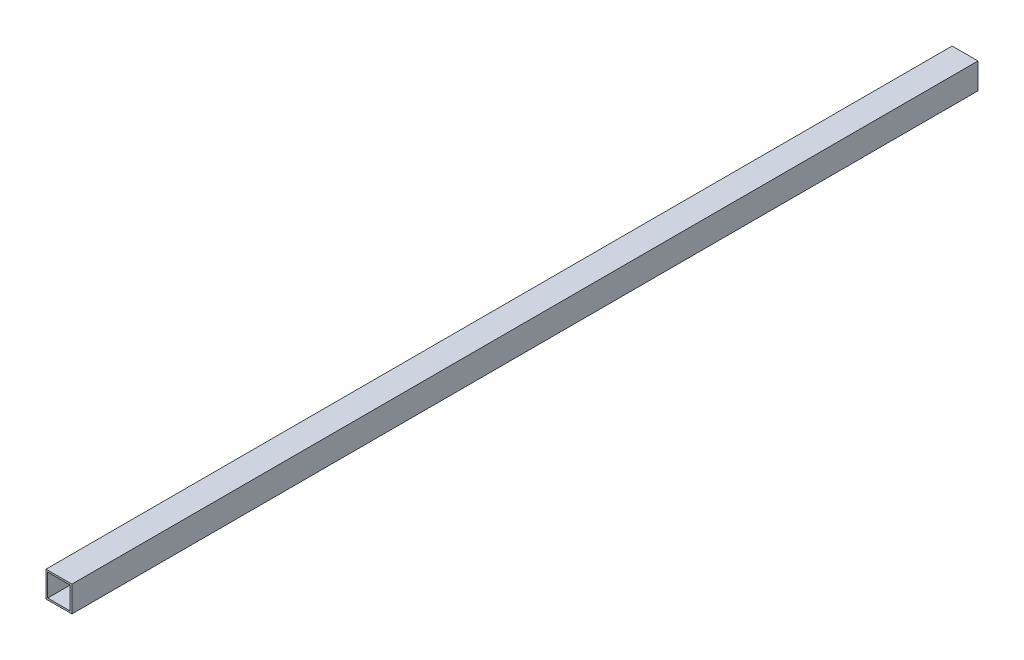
ISO-10303-21;
HEADER;
FILE_DESCRIPTION(('STEP AP214'),'2;1');
FILE_NAME('part.step','',(''),(''),'','','');
FILE_SCHEMA(('AUTOMOTIVE_DESIGN { 1 0 10303 214 1 1 1 1 }'));
ENDSEC;
DATA;
#1=APPLICATION_CONTEXT('core data for automotive mechanical design processes');
#2=APPLICATION_PROTOCOL_DEFINITION('international standard','automotive_design',2000,#1);
#3=PRODUCT_CONTEXT('',#1,'mechanical');
#4=PRODUCT('Part','Part','',(#3));
#5=PRODUCT_RELATED_PRODUCT_CATEGORY('part','',(#4));
#6=PRODUCT_DEFINITION_FORMATION('','',#4);
#7=PRODUCT_DEFINITION_CONTEXT('part definition',#1,'design');
#8=PRODUCT_DEFINITION('design','',#6,#7);
#9=PRODUCT_DEFINITION_SHAPE('','',#8);
#10=(LENGTH_UNIT() NAMED_UNIT(*) SI_UNIT(.MILLI.,.METRE.));
#11=(NAMED_UNIT(*) PLANE_ANGLE_UNIT() SI_UNIT($,.RADIAN.));
#12=(NAMED_UNIT(*) SI_UNIT($,.STERADIAN.) SOLID_ANGLE_UNIT());
#13=UNCERTAINTY_MEASURE_WITH_UNIT(LENGTH_MEASURE(1.E-05),#10,'distance_accuracy_value','');
#14=(GEOMETRIC_REPRESENTATION_CONTEXT(3) GLOBAL_UNCERTAINTY_ASSIGNED_CONTEXT((#13)) GLOBAL_UNIT_ASSIGNED_CONTEXT((#10,
#11,#12)) REPRESENTATION_CONTEXT('',''));
#15=CARTESIAN_POINT('',(0.,0.,0.));
#16=DIRECTION('',(0.,0.,1.));
#17=DIRECTION('',(1.,0.,0.));
#18=AXIS2_PLACEMENT_3D('',#15,#16,#17);
#19=CARTESIAN_POINT('',(0.,0.,2100.));
#20=DIRECTION('',(0.,0.,1.));
#21=DIRECTION('',(1.,0.,0.));
#22=AXIS2_PLACEMENT_3D('',#19,#20,#21);
#23=PLANE('',#22);
#24=DIRECTION('',(0.,-1.,0.));
#25=VECTOR('',#24,1.);
#26=CARTESIAN_POINT('',(-26.,26.,2100.));
#27=LINE('',#26,#25);
#28=CARTESIAN_POINT('',(-26.,26.,2100.));
#29=VERTEX_POINT('',#28);
#30=CARTESIAN_POINT('',(-26.,-26.,2100.));
#31=VERTEX_POINT('',#30);
#32=EDGE_CURVE('E25',#29,#31,#27,.T.);
#33=ORIENTED_EDGE('',*,*,#32,.F.);
#34=DIRECTION('',(-1.,0.,0.));
#35=VECTOR('',#34,1.);
#36=CARTESIAN_POINT('',(26.,26.,2100.));
#37=LINE('',#36,#35);
#38=CARTESIAN_POINT('',(26.,26.,2100.));
#39=VERTEX_POINT('',#38);
#40=EDGE_CURVE('E132',#39,#29,#37,.T.);
#41=ORIENTED_EDGE('',*,*,#40,.F.);
#42=DIRECTION('',(0.,1.,0.));
#43=VECTOR('',#42,1.);
#44=CARTESIAN_POINT('',(26.,-26.,2100.));
#45=LINE('',#44,#43);
#46=CARTESIAN_POINT('',(26.,-26.,2100.));
#47=VERTEX_POINT('',#46);
#48=EDGE_CURVE('E103',#47,#39,#45,.T.);
#49=ORIENTED_EDGE('',*,*,#48,.F.);
#50=DIRECTION('',(1.,0.,0.));
#51=VECTOR('',#50,1.);
#52=CARTESIAN_POINT('',(-26.,-26.,2100.));
#53=LINE('',#52,#51);
#54=EDGE_CURVE('E100',#31,#47,#53,.T.);
#55=ORIENTED_EDGE('',*,*,#54,.F.);
#56=EDGE_LOOP('',(#33,#41,#49,#55));
#57=FACE_BOUND('',#56,.T.);
#58=DIRECTION('',(1.,0.,0.));
#59=VECTOR('',#58,1.);
#60=CARTESIAN_POINT('',(-30.,-30.,2100.));
#61=LINE('',#60,#59);
#62=CARTESIAN_POINT('',(-30.,-30.,2100.));
#63=VERTEX_POINT('',#62);
#64=CARTESIAN_POINT('',(30.,-30.,2100.));
#65=VERTEX_POINT('',#64);
#66=EDGE_CURVE('E155',#63,#65,#61,.T.);
#67=ORIENTED_EDGE('',*,*,#66,.T.);
#68=DIRECTION('',(0.,1.,0.));
#69=VECTOR('',#68,1.);
#70=CARTESIAN_POINT('',(30.,-30.,2100.));
#71=LINE('',#70,#69);
#72=CARTESIAN_POINT('',(30.,30.,2100.));
#73=VERTEX_POINT('',#72);
#74=EDGE_CURVE('E149',#65,#73,#71,.T.);
#75=ORIENTED_EDGE('',*,*,#74,.T.);
#76=DIRECTION('',(-1.,0.,0.));
#77=VECTOR('',#76,1.);
#78=CARTESIAN_POINT('',(30.,30.,2100.));
#79=LINE('',#78,#77);
#80=CARTESIAN_POINT('',(-30.,30.,2100.));
#81=VERTEX_POINT('',#80);
#82=EDGE_CURVE('E166',#73,#81,#79,.T.);
#83=ORIENTED_EDGE('',*,*,#82,.T.);
#84=DIRECTION('',(0.,-1.,0.));
#85=VECTOR('',#84,1.);
#86=CARTESIAN_POINT('',(-30.,30.,2100.));
#87=LINE('',#86,#85);
#88=EDGE_CURVE('E115',#81,#63,#87,.T.);
#89=ORIENTED_EDGE('',*,*,#88,.T.);
#90=EDGE_LOOP('',(#67,#75,#83,#89));
#91=FACE_BOUND('',#90,.T.);
#92=ADVANCED_FACE('F16',(#57,#91),#23,.T.);
#93=CARTESIAN_POINT('',(0.,0.,0.));
#94=DIRECTION('',(0.,0.,1.));
#95=DIRECTION('',(1.,0.,0.));
#96=AXIS2_PLACEMENT_3D('',#93,#94,#95);
#97=PLANE('',#96);
#98=DIRECTION('',(1.,0.,0.));
#99=VECTOR('',#98,1.);
#100=CARTESIAN_POINT('',(-26.,-26.,0.));
#101=LINE('',#100,#99);
#102=CARTESIAN_POINT('',(-26.,-26.,0.));
#103=VERTEX_POINT('',#102);
#104=CARTESIAN_POINT('',(26.,-26.,0.));
#105=VERTEX_POINT('',#104);
#106=EDGE_CURVE('E113',#103,#105,#101,.T.);
#107=ORIENTED_EDGE('',*,*,#106,.T.);
#108=DIRECTION('',(0.,1.,0.));
#109=VECTOR('',#108,1.);
#110=CARTESIAN_POINT('',(26.,-26.,0.));
#111=LINE('',#110,#109);
#112=CARTESIAN_POINT('',(26.,26.,0.));
#113=VERTEX_POINT('',#112);
#114=EDGE_CURVE('E128',#105,#113,#111,.T.);
#115=ORIENTED_EDGE('',*,*,#114,.T.);
#116=DIRECTION('',(-1.,0.,0.));
#117=VECTOR('',#116,1.);
#118=CARTESIAN_POINT('',(26.,26.,0.));
#119=LINE('',#118,#117);
#120=CARTESIAN_POINT('',(-26.,26.,0.));
#121=VERTEX_POINT('',#120);
#122=EDGE_CURVE('E98',#113,#121,#119,.T.);
#123=ORIENTED_EDGE('',*,*,#122,.T.);
#124=DIRECTION('',(0.,-1.,0.));
#125=VECTOR('',#124,1.);
#126=CARTESIAN_POINT('',(-26.,26.,0.));
#127=LINE('',#126,#125);
#128=EDGE_CURVE('E10',#121,#103,#127,.T.);
#129=ORIENTED_EDGE('',*,*,#128,.T.);
#130=EDGE_LOOP('',(#107,#115,#123,#129));
#131=FACE_BOUND('',#130,.T.);
#132=DIRECTION('',(0.,-1.,0.));
#133=VECTOR('',#132,1.);
#134=CARTESIAN_POINT('',(-30.,30.,0.));
#135=LINE('',#134,#133);
#136=CARTESIAN_POINT('',(-30.,30.,0.));
#137=VERTEX_POINT('',#136);
#138=CARTESIAN_POINT('',(-30.,-30.,0.));
#139=VERTEX_POINT('',#138);
#140=EDGE_CURVE('E119',#137,#139,#135,.T.);
#141=ORIENTED_EDGE('',*,*,#140,.F.);
#142=DIRECTION('',(-1.,0.,0.));
#143=VECTOR('',#142,1.);
#144=CARTESIAN_POINT('',(30.,30.,0.));
#145=LINE('',#144,#143);
#146=CARTESIAN_POINT('',(30.,30.,0.));
#147=VERTEX_POINT('',#146);
#148=EDGE_CURVE('E174',#147,#137,#145,.T.);
#149=ORIENTED_EDGE('',*,*,#148,.F.);
#150=DIRECTION('',(0.,1.,0.));
#151=VECTOR('',#150,1.);
#152=CARTESIAN_POINT('',(30.,-30.,0.));
#153=LINE('',#152,#151);
#154=CARTESIAN_POINT('',(30.,-30.,0.));
#155=VERTEX_POINT('',#154);
#156=EDGE_CURVE('E150',#155,#147,#153,.T.);
#157=ORIENTED_EDGE('',*,*,#156,.F.);
#158=DIRECTION('',(1.,0.,0.));
#159=VECTOR('',#158,1.);
#160=CARTESIAN_POINT('',(-30.,-30.,0.));
#161=LINE('',#160,#159);
#162=EDGE_CURVE('E156',#139,#155,#161,.T.);
#163=ORIENTED_EDGE('',*,*,#162,.F.);
#164=EDGE_LOOP('',(#141,#149,#157,#163));
#165=FACE_BOUND('',#164,.T.);
#166=ADVANCED_FACE('F18',(#131,#165),#97,.F.);
#167=CARTESIAN_POINT('',(-26.,26.,0.));
#168=DIRECTION('',(1.,0.,0.));
#169=DIRECTION('',(0.,1.,0.));
#170=AXIS2_PLACEMENT_3D('',#167,#168,#169);
#171=PLANE('',#170);
#172=DIRECTION('',(0.,0.,1.));
#173=VECTOR('',#172,1.);
#174=CARTESIAN_POINT('',(-26.,26.,0.));
#175=LINE('',#174,#173);
#176=EDGE_CURVE('E95',#121,#29,#175,.T.);
#177=ORIENTED_EDGE('',*,*,#176,.T.);
#178=ORIENTED_EDGE('',*,*,#32,.T.);
#179=DIRECTION('',(0.,0.,1.));
#180=VECTOR('',#179,1.);
#181=CARTESIAN_POINT('',(-26.,-26.,0.));
#182=LINE('',#181,#180);
#183=EDGE_CURVE('E93',#103,#31,#182,.T.);
#184=ORIENTED_EDGE('',*,*,#183,.F.);
#185=ORIENTED_EDGE('',*,*,#128,.F.);
#186=EDGE_LOOP('',(#177,#178,#184,#185));
#187=FACE_BOUND('',#186,.T.);
#188=ADVANCED_FACE('F91',(#187),#171,.T.);
#189=CARTESIAN_POINT('',(26.,26.,0.));
#190=DIRECTION('',(0.,-1.,0.));
#191=DIRECTION('',(0.,0.,-1.));
#192=AXIS2_PLACEMENT_3D('',#189,#190,#191);
#193=PLANE('',#192);
#194=DIRECTION('',(0.,0.,1.));
#195=VECTOR('',#194,1.);
#196=CARTESIAN_POINT('',(26.,26.,0.));
#197=LINE('',#196,#195);
#198=EDGE_CURVE('E127',#113,#39,#197,.T.);
#199=ORIENTED_EDGE('',*,*,#198,.T.);
#200=ORIENTED_EDGE('',*,*,#40,.T.);
#201=ORIENTED_EDGE('',*,*,#176,.F.);
#202=ORIENTED_EDGE('',*,*,#122,.F.);
#203=EDGE_LOOP('',(#199,#200,#201,#202));
#204=FACE_BOUND('',#203,.T.);
#205=ADVANCED_FACE('F212',(#204),#193,.T.);
#206=CARTESIAN_POINT('',(26.,-26.,0.));
#207=DIRECTION('',(-1.,0.,0.));
#208=DIRECTION('',(0.,0.,1.));
#209=AXIS2_PLACEMENT_3D('',#206,#207,#208);
#210=PLANE('',#209);
#211=DIRECTION('',(0.,0.,1.));
#212=VECTOR('',#211,1.);
#213=CARTESIAN_POINT('',(26.,-26.,0.));
#214=LINE('',#213,#212);
#215=EDGE_CURVE('E108',#105,#47,#214,.T.);
#216=ORIENTED_EDGE('',*,*,#215,.T.);
#217=ORIENTED_EDGE('',*,*,#48,.T.);
#218=ORIENTED_EDGE('',*,*,#198,.F.);
#219=ORIENTED_EDGE('',*,*,#114,.F.);
#220=EDGE_LOOP('',(#216,#217,#218,#219));
#221=FACE_BOUND('',#220,.T.);
#222=ADVANCED_FACE('F214',(#221),#210,.T.);
#223=CARTESIAN_POINT('',(-26.,-26.,0.));
#224=DIRECTION('',(0.,1.,0.));
#225=DIRECTION('',(1.,0.,0.));
#226=AXIS2_PLACEMENT_3D('',#223,#224,#225);
#227=PLANE('',#226);
#228=ORIENTED_EDGE('',*,*,#183,.T.);
#229=ORIENTED_EDGE('',*,*,#54,.T.);
#230=ORIENTED_EDGE('',*,*,#215,.F.);
#231=ORIENTED_EDGE('',*,*,#106,.F.);
#232=EDGE_LOOP('',(#228,#229,#230,#231));
#233=FACE_BOUND('',#232,.T.);
#234=ADVANCED_FACE('F111',(#233),#227,.T.);
#235=CARTESIAN_POINT('',(-30.,30.,0.));
#236=DIRECTION('',(1.,0.,0.));
#237=DIRECTION('',(0.,1.,0.));
#238=AXIS2_PLACEMENT_3D('',#235,#236,#237);
#239=PLANE('',#238);
#240=ORIENTED_EDGE('',*,*,#140,.T.);
#241=DIRECTION('',(0.,0.,1.));
#242=VECTOR('',#241,1.);
#243=CARTESIAN_POINT('',(-30.,-30.,0.));
#244=LINE('',#243,#242);
#245=EDGE_CURVE('E160',#139,#63,#244,.T.);
#246=ORIENTED_EDGE('',*,*,#245,.T.);
#247=ORIENTED_EDGE('',*,*,#88,.F.);
#248=DIRECTION('',(0.,0.,1.));
#249=VECTOR('',#248,1.);
#250=CARTESIAN_POINT('',(-30.,30.,0.));
#251=LINE('',#250,#249);
#252=EDGE_CURVE('E170',#137,#81,#251,.T.);
#253=ORIENTED_EDGE('',*,*,#252,.F.);
#254=EDGE_LOOP('',(#240,#246,#247,#253));
#255=FACE_BOUND('',#254,.T.);
#256=ADVANCED_FACE('F230',(#255),#239,.F.);
#257=CARTESIAN_POINT('',(30.,30.,0.));
#258=DIRECTION('',(0.,-1.,0.));
#259=DIRECTION('',(0.,0.,-1.));
#260=AXIS2_PLACEMENT_3D('',#257,#258,#259);
#261=PLANE('',#260);
#262=ORIENTED_EDGE('',*,*,#148,.T.);
#263=ORIENTED_EDGE('',*,*,#252,.T.);
#264=ORIENTED_EDGE('',*,*,#82,.F.);
#265=DIRECTION('',(0.,0.,1.));
#266=VECTOR('',#265,1.);
#267=CARTESIAN_POINT('',(30.,30.,0.));
#268=LINE('',#267,#266);
#269=EDGE_CURVE('E146',#147,#73,#268,.T.);
#270=ORIENTED_EDGE('',*,*,#269,.F.);
#271=EDGE_LOOP('',(#262,#263,#264,#270));
#272=FACE_BOUND('',#271,.T.);
#273=ADVANCED_FACE('F233',(#272),#261,.F.);
#274=CARTESIAN_POINT('',(30.,-30.,0.));
#275=DIRECTION('',(-1.,0.,0.));
#276=DIRECTION('',(0.,0.,1.));
#277=AXIS2_PLACEMENT_3D('',#274,#275,#276);
#278=PLANE('',#277);
#279=ORIENTED_EDGE('',*,*,#156,.T.);
#280=ORIENTED_EDGE('',*,*,#269,.T.);
#281=ORIENTED_EDGE('',*,*,#74,.F.);
#282=DIRECTION('',(0.,0.,1.));
#283=VECTOR('',#282,1.);
#284=CARTESIAN_POINT('',(30.,-30.,0.));
#285=LINE('',#284,#283);
#286=EDGE_CURVE('E151',#155,#65,#285,.T.);
#287=ORIENTED_EDGE('',*,*,#286,.F.);
#288=EDGE_LOOP('',(#279,#280,#281,#287));
#289=FACE_BOUND('',#288,.T.);
#290=ADVANCED_FACE('F227',(#289),#278,.F.);
#291=CARTESIAN_POINT('',(-30.,-30.,0.));
#292=DIRECTION('',(0.,1.,0.));
#293=DIRECTION('',(1.,0.,0.));
#294=AXIS2_PLACEMENT_3D('',#291,#292,#293);
#295=PLANE('',#294);
#296=ORIENTED_EDGE('',*,*,#162,.T.);
#297=ORIENTED_EDGE('',*,*,#286,.T.);
#298=ORIENTED_EDGE('',*,*,#66,.F.);
#299=ORIENTED_EDGE('',*,*,#245,.F.);
#300=EDGE_LOOP('',(#296,#297,#298,#299));
#301=FACE_BOUND('',#300,.T.);
#302=ADVANCED_FACE('F195',(#301),#295,.F.);
#303=CLOSED_SHELL('',(#92,#166,#188,#205,#222,#234,#256,#273,#290,#302));
#304=MANIFOLD_SOLID_BREP('B1',#303);
#305=ADVANCED_BREP_SHAPE_REPRESENTATION('',(#18,#304),#14);
#306=SHAPE_DEFINITION_REPRESENTATION(#9,#305);
ENDSEC;
END-ISO-10303-21;
